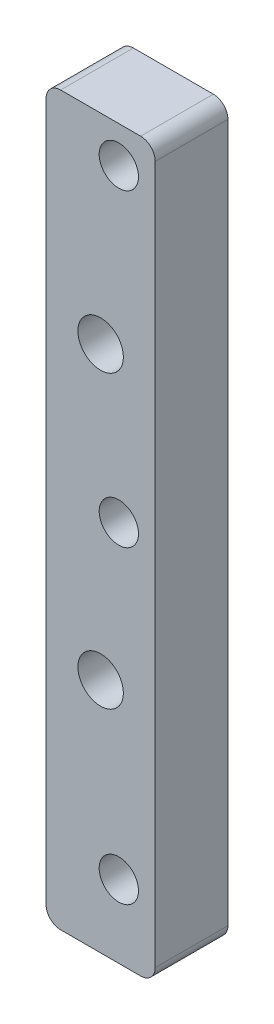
from build123d import *

# Parameters (mm, degrees)
SKETCH1_W           = 19.05
SKETCH1_H           = 127
BOSS_EXTRUDE1_DEPTH = 12.7
SKETCH2_R           = 3.429
CUT_EXTRUDE1_DEPTH  = 75.190903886
SKETCH3_R           = 3.96875
CUT_EXTRUDE2_DEPTH  = 75.190903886
FILLET1_R           = 2.54


with BuildPart() as part:
    # Sketch1 → Boss-Extrude1 (new body)
    with BuildSketch(Plane.XY):
        with Locations((1.83566035, -8.707586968)):
            Rectangle(SKETCH1_W, SKETCH1_H)
    extrude(amount=BOSS_EXTRUDE1_DEPTH)

    # Sketch2 → Cut-Extrude1 (cut, through all)
    with BuildSketch(Plane.XY.offset(12.7)):
        with Locations((5.01066035, 48.442413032)):
            Circle(SKETCH2_R)
        with Locations((5.01066035, -59.507586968)):
            Circle(SKETCH2_R)
        with Locations((5.01066035, -5.532586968)):
            Circle(SKETCH2_R)
    extrude(amount=-CUT_EXTRUDE1_DEPTH, mode=Mode.SUBTRACT)

    # Sketch3 → Cut-Extrude2 (cut, through all)
    with BuildSketch(Plane.XY.offset(12.7)):
        with Locations((1.83566035, 19.867413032)):
            Circle(SKETCH3_R)
        with Locations((1.83566035, -30.932586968)):
            Circle(SKETCH3_R)
    extrude(amount=-CUT_EXTRUDE2_DEPTH, mode=Mode.SUBTRACT)

    # Fillet1
    fillet1_edges = [part.edges().sort_by_distance(p)[0] for p in [
        (-7.68933965, 54.792413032, 6.35),
        (11.36066035, 54.792413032, 6.35),
        (11.36066035, -72.207586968, 6.35),
        (-7.68933965, -72.207586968, 6.35),
    ]]
    fillet(fillet1_edges, radius=FILLET1_R)


solid = part.part
